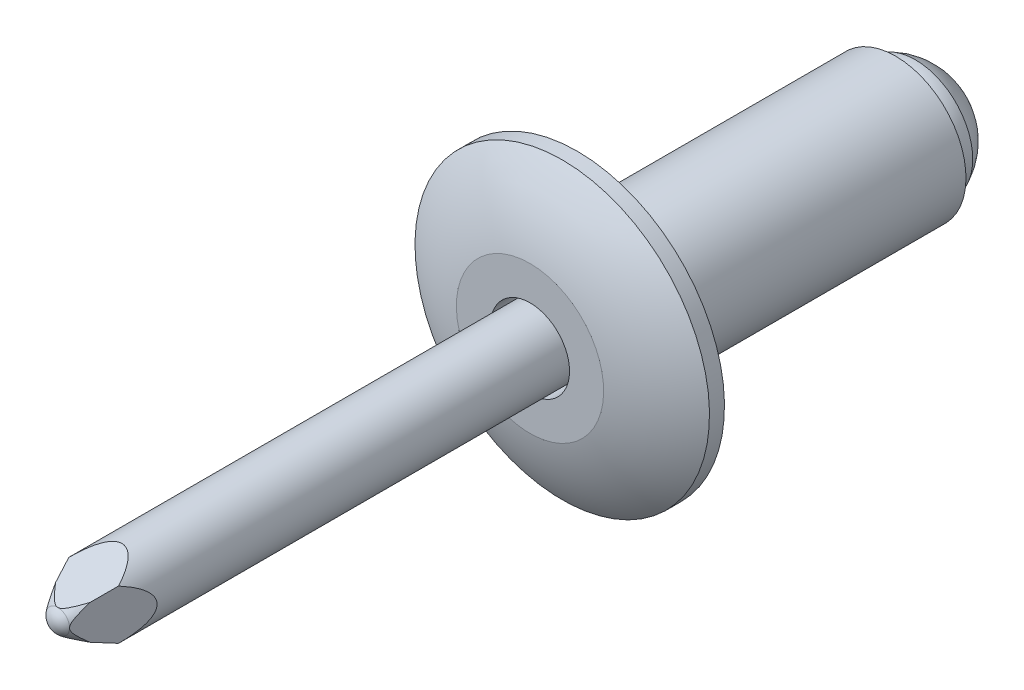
ISO-10303-21;
HEADER;
FILE_DESCRIPTION(('STEP AP214'),'2;1');
FILE_NAME('part.step','',(''),(''),'','','');
FILE_SCHEMA(('AUTOMOTIVE_DESIGN { 1 0 10303 214 1 1 1 1 }'));
ENDSEC;
DATA;
#1=APPLICATION_CONTEXT('core data for automotive mechanical design processes');
#2=APPLICATION_PROTOCOL_DEFINITION('international standard','automotive_design',2000,#1);
#3=PRODUCT_CONTEXT('',#1,'mechanical');
#4=PRODUCT('Part','Part','',(#3));
#5=PRODUCT_RELATED_PRODUCT_CATEGORY('part','',(#4));
#6=PRODUCT_DEFINITION_FORMATION('','',#4);
#7=PRODUCT_DEFINITION_CONTEXT('part definition',#1,'design');
#8=PRODUCT_DEFINITION('design','',#6,#7);
#9=PRODUCT_DEFINITION_SHAPE('','',#8);
#10=(LENGTH_UNIT() NAMED_UNIT(*) SI_UNIT(.MILLI.,.METRE.));
#11=(NAMED_UNIT(*) PLANE_ANGLE_UNIT() SI_UNIT($,.RADIAN.));
#12=(NAMED_UNIT(*) SI_UNIT($,.STERADIAN.) SOLID_ANGLE_UNIT());
#13=UNCERTAINTY_MEASURE_WITH_UNIT(LENGTH_MEASURE(1.E-05),#10,'distance_accuracy_value','');
#14=(GEOMETRIC_REPRESENTATION_CONTEXT(3) GLOBAL_UNCERTAINTY_ASSIGNED_CONTEXT((#13)) GLOBAL_UNIT_ASSIGNED_CONTEXT((#10,
#11,#12)) REPRESENTATION_CONTEXT('',''));
#15=CARTESIAN_POINT('',(0.,0.,0.));
#16=DIRECTION('',(0.,0.,1.));
#17=DIRECTION('',(1.,0.,0.));
#18=AXIS2_PLACEMENT_3D('',#15,#16,#17);
#19=CARTESIAN_POINT('',(0.,0.,-11.2391976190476));
#20=DIRECTION('',(0.,0.,1.));
#21=DIRECTION('',(0.,1.,0.));
#22=AXIS2_PLACEMENT_3D('',#19,#20,#21);
#23=SPHERICAL_SURFACE('',#22,1.95610238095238);
#24=CARTESIAN_POINT('',(0.,0.,-10.795));
#25=DIRECTION('',(0.,0.,1.));
#26=DIRECTION('',(1.,0.,0.));
#27=AXIS2_PLACEMENT_3D('',#24,#25,#26);
#28=CIRCLE('',#27,1.905);
#29=CARTESIAN_POINT('',(0.,1.905,-10.795));
#30=VERTEX_POINT('',#29);
#31=EDGE_CURVE('E11',#30,#30,#28,.T.);
#32=CARTESIAN_POINT('',(0.,0.,-11.4612964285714));
#33=DIRECTION('',(0.,0.,1.));
#34=DIRECTION('',(1.,0.,0.));
#35=AXIS2_PLACEMENT_3D('',#32,#33,#34);
#36=CIRCLE('',#35,1.94345276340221);
#37=CARTESIAN_POINT('',(0.,1.94345276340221,-11.4612964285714));
#38=VERTEX_POINT('',#37);
#39=EDGE_CURVE('E61',#38,#38,#36,.T.);
#40=CARTESIAN_POINT('',(0.,1.905,-10.795));
#41=CARTESIAN_POINT('',(0.,1.90658647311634,-10.8018037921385));
#42=CARTESIAN_POINT('',(0.,1.9081364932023,-10.8086160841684));
#43=CARTESIAN_POINT('',(0.,1.91116345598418,-10.8222568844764));
#44=CARTESIAN_POINT('',(0.,1.9126403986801,-10.8290853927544));
#45=CARTESIAN_POINT('',(0.,1.91552103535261,-10.8427578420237));
#46=CARTESIAN_POINT('',(0.,1.9169247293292,-10.8496017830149));
#47=CARTESIAN_POINT('',(0.,1.91965870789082,-10.863304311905));
#48=CARTESIAN_POINT('',(0.,1.92098899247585,-10.870162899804));
#49=CARTESIAN_POINT('',(0.,1.92357599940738,-10.8838939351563));
#50=CARTESIAN_POINT('',(0.,1.92483272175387,-10.8907663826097));
#51=CARTESIAN_POINT('',(0.,1.92727245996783,-10.9045243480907));
#52=CARTESIAN_POINT('',(0.,1.92845547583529,-10.9114098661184));
#53=CARTESIAN_POINT('',(0.,1.93074766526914,-10.9251931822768));
#54=CARTESIAN_POINT('',(0.,1.93185683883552,-10.9320909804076));
#55=CARTESIAN_POINT('',(0.,1.93400121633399,-10.9458980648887));
#56=CARTESIAN_POINT('',(0.,1.93503642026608,-10.9528073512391));
#57=CARTESIAN_POINT('',(0.,1.93703273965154,-10.9666366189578));
#58=CARTESIAN_POINT('',(0.,1.93799385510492,-10.9735566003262));
#59=CARTESIAN_POINT('',(0.,1.93984188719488,-10.9874064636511));
#60=CARTESIAN_POINT('',(0.,1.94072880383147,-10.9943363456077));
#61=CARTESIAN_POINT('',(0.,1.94242833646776,-11.008205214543));
#62=CARTESIAN_POINT('',(0.,1.94324095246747,-11.0151442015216));
#63=CARTESIAN_POINT('',(0.,1.94479179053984,-11.0290304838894));
#64=CARTESIAN_POINT('',(0.,1.9455300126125,-11.0359777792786));
#65=CARTESIAN_POINT('',(0.,1.94693197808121,-11.0498798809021));
#66=CARTESIAN_POINT('',(0.,1.94759572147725,-11.0568346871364));
#67=CARTESIAN_POINT('',(0.,1.94884865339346,-11.0707510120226));
#68=CARTESIAN_POINT('',(0.,1.94943784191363,-11.0777125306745));
#69=CARTESIAN_POINT('',(0.,1.95054159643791,-11.0916414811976));
#70=CARTESIAN_POINT('',(0.,1.95105616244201,-11.0986089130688));
#71=CARTESIAN_POINT('',(0.,1.95201061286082,-11.1125488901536));
#72=CARTESIAN_POINT('',(0.,1.95245049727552,-11.1195214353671));
#73=CARTESIAN_POINT('',(0.,1.95325553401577,-11.1334708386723));
#74=CARTESIAN_POINT('',(0.,1.95362068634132,-11.140447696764));
#75=CARTESIAN_POINT('',(0.,1.95427621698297,-11.1544049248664));
#76=CARTESIAN_POINT('',(0.,1.95456659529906,-11.1613852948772));
#77=CARTESIAN_POINT('',(0.,1.95507254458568,-11.1753487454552));
#78=CARTESIAN_POINT('',(0.,1.95528811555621,-11.1823318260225));
#79=CARTESIAN_POINT('',(0.,1.95564442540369,-11.1962998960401));
#80=CARTESIAN_POINT('',(0.,1.95578516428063,-11.2032848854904));
#81=CARTESIAN_POINT('',(0.,1.95599179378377,-11.2172559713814));
#82=CARTESIAN_POINT('',(0.,1.95605768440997,-11.2242420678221));
#83=CARTESIAN_POINT('',(0.,1.95611460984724,-11.2382145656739));
#84=CARTESIAN_POINT('',(0.,1.95610564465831,-11.2452009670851));
#85=CARTESIAN_POINT('',(0.,1.95601285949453,-11.2591732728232));
#86=CARTESIAN_POINT('',(0.,1.95592903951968,-11.2661591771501));
#87=CARTESIAN_POINT('',(0.,1.95568655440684,-11.2801296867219));
#88=CARTESIAN_POINT('',(0.,1.95552788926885,-11.2871142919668));
#89=CARTESIAN_POINT('',(0.,1.95513573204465,-11.3010814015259));
#90=CARTESIAN_POINT('',(0.,1.95490223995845,-11.3080639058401));
#91=CARTESIAN_POINT('',(0.,1.95436045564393,-11.3220260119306));
#92=CARTESIAN_POINT('',(0.,1.95405216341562,-11.3290056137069));
#93=CARTESIAN_POINT('',(0.,1.95336081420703,-11.342961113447));
#94=CARTESIAN_POINT('',(0.,1.95297775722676,-11.3499370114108));
#95=CARTESIAN_POINT('',(0.,1.95213692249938,-11.363884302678));
#96=CARTESIAN_POINT('',(0.,1.95167914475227,-11.3708556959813));
#97=CARTESIAN_POINT('',(0.,1.95068892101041,-11.3847931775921));
#98=CARTESIAN_POINT('',(0.,1.95015647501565,-11.3917592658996));
#99=CARTESIAN_POINT('',(0.,1.94901697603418,-11.4056853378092));
#100=CARTESIAN_POINT('',(0.,1.94840992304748,-11.4126453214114));
#101=CARTESIAN_POINT('',(0.,1.94712127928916,-11.4265583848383));
#102=CARTESIAN_POINT('',(0.,1.94643968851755,-11.4335114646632));
#103=CARTESIAN_POINT('',(0.,1.94500204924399,-11.4474099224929));
#104=CARTESIAN_POINT('',(0.,1.94424600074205,-11.4543553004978));
#105=CARTESIAN_POINT('',(0.,1.94345276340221,-11.4612964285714));
#106=B_SPLINE_CURVE_WITH_KNOTS('',3,(#40,#41,#42,#43,#44,#45,#46,#47,#48,#49,#50,#51,#52,#53,
#54,#55,#56,#57,#58,#59,#60,#61,#62,#63,#64,#65,#66,#67,#68,#69,#70,#71,#72,#73,#74,#75,#76,#77,
#78,#79,#80,#81,#82,#83,#84,#85,#86,#87,#88,#89,#90,#91,#92,#93,#94,#95,#96,#97,#98,#99,#100,
#101,#102,#103,#104,#105),.UNSPECIFIED.,.F.,.F.,(4,2,2,2,2,2,2,2,2,2,2,2,2,2,2,2,2,2,2,2,2,2,2,
2,2,2,2,2,2,2,2,2,4),(0.,0.0209588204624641,0.0419176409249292,0.0628764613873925,
0.0838352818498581,0.104794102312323,0.125752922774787,0.146711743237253,0.167670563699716,
0.188629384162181,0.209588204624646,0.23054702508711,0.251505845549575,0.27246466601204,
0.293423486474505,0.314382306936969,0.335341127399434,0.3562999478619,0.377258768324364,
0.398217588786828,0.419176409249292,0.440135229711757,0.461094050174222,0.482052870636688,
0.503011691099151,0.523970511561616,0.544929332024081,0.565888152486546,0.58684697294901,
0.607805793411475,0.628764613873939,0.649723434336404,0.670682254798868),.UNSPECIFIED.);
#107=EDGE_CURVE('BSEAM53',#30,#38,#106,.T.);
#108=ORIENTED_EDGE('',*,*,#31,.F.);
#109=ORIENTED_EDGE('',*,*,#39,.T.);
#110=ORIENTED_EDGE('',*,*,#107,.T.);
#111=ORIENTED_EDGE('',*,*,#107,.F.);
#112=EDGE_LOOP('',(#108,#110,#109,#111));
#113=FACE_BOUND('',#112,.T.);
#114=ADVANCED_FACE('F53',(#113),#23,.T.);
#115=CARTESIAN_POINT('',(0.,1.905,-10.795));
#116=DIRECTION('',(0.,0.,-1.));
#117=DIRECTION('',(-1.,0.,0.));
#118=AXIS2_PLACEMENT_3D('',#115,#116,#117);
#119=PLANE('',#118);
#120=ORIENTED_EDGE('',*,*,#31,.T.);
#121=EDGE_LOOP('',(#120));
#122=FACE_BOUND('',#121,.T.);
#123=ADVANCED_FACE('F73',(#122),#119,.F.);
#124=CARTESIAN_POINT('',(0.,0.,-10.566887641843));
#125=DIRECTION('',(0.,0.,1.));
#126=DIRECTION('',(0.,-1.,0.));
#127=AXIS2_PLACEMENT_3D('',#124,#125,#126);
#128=SPHERICAL_SURFACE('',#127,2.13938676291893);
#129=ORIENTED_EDGE('',*,*,#39,.F.);
#130=EDGE_LOOP('',(#129));
#131=FACE_BOUND('',#130,.T.);
#132=ADVANCED_FACE('F72',(#131),#128,.T.);
#133=CLOSED_SHELL('',(#114,#123,#132));
#134=MANIFOLD_SOLID_BREP('B2',#133);
#135=CARTESIAN_POINT('',(0.,0.,16.6632440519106));
#136=DIRECTION('',(0.,0.,-1.));
#137=DIRECTION('',(-1.,0.,0.));
#138=AXIS2_PLACEMENT_3D('',#135,#136,#137);
#139=CONICAL_SURFACE('',#138,1.190625,0.698131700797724);
#140=CARTESIAN_POINT('',(-0.742468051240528,0.93098267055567,16.6630440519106));
#141=CARTESIAN_POINT('',(-0.725824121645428,0.895163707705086,16.7087728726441));
#142=CARTESIAN_POINT('',(-0.709198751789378,0.85927020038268,16.7544507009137));
#143=CARTESIAN_POINT('',(-0.676010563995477,0.787210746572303,16.8456344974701));
#144=CARTESIAN_POINT('',(-0.659447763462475,0.751044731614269,16.8911404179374));
#145=CARTESIAN_POINT('',(-0.626430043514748,0.67836009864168,16.9818558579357));
#146=CARTESIAN_POINT('',(-0.609975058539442,0.641841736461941,17.0270655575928));
#147=CARTESIAN_POINT('',(-0.577227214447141,0.568204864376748,17.1170395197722));
#148=CARTESIAN_POINT('',(-0.560934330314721,0.531086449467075,17.1618038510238));
#149=CARTESIAN_POINT('',(-0.528622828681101,0.455822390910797,17.2505789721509));
#150=CARTESIAN_POINT('',(-0.512604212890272,0.417676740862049,17.2945897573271));
#151=CARTESIAN_POINT('',(-0.489001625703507,0.358848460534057,17.3594373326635));
#152=CARTESIAN_POINT('',(-0.481193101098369,0.338938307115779,17.3808910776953));
#153=CARTESIAN_POINT('',(-0.465824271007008,0.298319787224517,17.4231165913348));
#154=CARTESIAN_POINT('',(-0.458263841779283,0.277611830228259,17.4438886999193));
#155=CARTESIAN_POINT('',(-0.443524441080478,0.234780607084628,17.4843848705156));
#156=CARTESIAN_POINT('',(-0.436348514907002,0.212648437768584,17.5041005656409));
#157=CARTESIAN_POINT('',(-0.422863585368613,0.166224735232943,17.5411501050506));
#158=CARTESIAN_POINT('',(-0.416550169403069,0.141945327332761,17.5584960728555));
#159=CARTESIAN_POINT('',(-0.409137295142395,0.10515981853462,17.5788627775));
#160=CARTESIAN_POINT('',(-0.407165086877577,0.094202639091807,17.584281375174));
#161=CARTESIAN_POINT('',(-0.403749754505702,0.0716025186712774,17.5936649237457));
#162=CARTESIAN_POINT('',(-0.402305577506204,0.0599609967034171,17.5976327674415));
#163=CARTESIAN_POINT('',(-0.400313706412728,0.0379530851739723,17.6031053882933));
#164=CARTESIAN_POINT('',(-0.399661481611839,0.027670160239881,17.6048973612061));
#165=CARTESIAN_POINT('',(-0.398975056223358,0.00692827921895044,17.6067832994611));
#166=CARTESIAN_POINT('',(-0.398940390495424,-0.00353053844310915,17.6068785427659));
#167=CARTESIAN_POINT('',(-0.399493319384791,-0.0242833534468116,17.6053593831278));
#168=CARTESIAN_POINT('',(-0.400079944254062,-0.0345775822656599,17.6037476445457));
#169=CARTESIAN_POINT('',(-0.401784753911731,-0.0547766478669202,17.5990637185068));
#170=CARTESIAN_POINT('',(-0.402903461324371,-0.0646810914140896,17.5959900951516));
#171=CARTESIAN_POINT('',(-0.406579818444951,-0.0915636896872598,17.585889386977));
#172=CARTESIAN_POINT('',(-0.409578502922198,-0.108013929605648,17.5776505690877));
#173=CARTESIAN_POINT('',(-0.416309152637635,-0.139607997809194,17.5591582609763));
#174=CARTESIAN_POINT('',(-0.420045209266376,-0.154743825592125,17.548893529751));
#175=CARTESIAN_POINT('',(-0.42807692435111,-0.184544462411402,17.5268265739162));
#176=CARTESIAN_POINT('',(-0.43238763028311,-0.199174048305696,17.5149830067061));
#177=CARTESIAN_POINT('',(-0.441288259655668,-0.227694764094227,17.4905287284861));
#178=CARTESIAN_POINT('',(-0.445878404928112,-0.241585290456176,17.477917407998));
#179=CARTESIAN_POINT('',(-0.459936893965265,-0.282541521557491,17.4392920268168));
#180=CARTESIAN_POINT('',(-0.469671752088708,-0.308818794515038,17.412545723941));
#181=CARTESIAN_POINT('',(-0.48954213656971,-0.360382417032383,17.3579522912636));
#182=CARTESIAN_POINT('',(-0.499679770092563,-0.385661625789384,17.3300993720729));
#183=CARTESIAN_POINT('',(-0.520141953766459,-0.435465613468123,17.2738799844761));
#184=CARTESIAN_POINT('',(-0.530466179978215,-0.459991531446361,17.2455144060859));
#185=CARTESIAN_POINT('',(-0.557497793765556,-0.523227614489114,17.1712456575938));
#186=CARTESIAN_POINT('',(-0.57430269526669,-0.561579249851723,17.1250745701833));
#187=CARTESIAN_POINT('',(-0.608094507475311,-0.637655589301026,17.0322323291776));
#188=CARTESIAN_POINT('',(-0.625081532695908,-0.675379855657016,16.9855608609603));
#189=CARTESIAN_POINT('',(-0.658773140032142,-0.749570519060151,16.8929939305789));
#190=CARTESIAN_POINT('',(-0.675475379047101,-0.786046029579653,16.847104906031));
#191=CARTESIAN_POINT('',(-0.708934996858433,-0.85869997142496,16.7551753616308));
#192=CARTESIAN_POINT('',(-0.725692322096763,-0.894878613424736,16.709134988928));
#193=CARTESIAN_POINT('',(-0.742468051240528,-0.93098267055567,16.6630440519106));
#194=B_SPLINE_CURVE_WITH_KNOTS('',3,(#140,#141,#142,#143,#144,#145,#146,#147,#148,#149,#150,
#151,#152,#153,#154,#155,#156,#157,#158,#159,#160,#161,#162,#163,#164,#165,#166,#167,#168,#169,
#170,#171,#172,#173,#174,#175,#176,#177,#178,#179,#180,#181,#182,#183,#184,#185,#186,#187,#188,
#189,#190,#191,#192,#193),.UNSPECIFIED.,.F.,.F.,(4,2,2,2,2,2,2,2,2,2,2,2,2,2,2,2,2,2,2,2,2,2,2,
2,2,2,4),(0.,0.181274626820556,0.36259642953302,0.543795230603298,0.724965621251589,
0.90613714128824,0.997007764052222,1.08783235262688,1.17929357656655,1.27026780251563,
1.30733354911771,1.34432497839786,1.37556025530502,1.40677200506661,1.4379351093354,
1.46912888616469,1.52472639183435,1.58064152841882,1.63852084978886,1.69644673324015,
1.81258697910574,1.92944614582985,2.04611891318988,2.23309823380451,2.42020296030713,
2.60305990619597,2.78577335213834),.UNSPECIFIED.);
#195=CARTESIAN_POINT('',(-0.399031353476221,0.,17.6066286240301));
#196=VERTEX_POINT('',#195);
#197=CARTESIAN_POINT('',(-0.584495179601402,-0.584495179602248,17.0970709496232));
#198=VERTEX_POINT('',#197);
#199=EDGE_CURVE('E206',#196,#198,#194,.T.);
#200=ORIENTED_EDGE('',*,*,#199,.T.);
#201=CARTESIAN_POINT('',(-0.8160994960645,-0.689317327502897,16.8090744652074));
#202=CARTESIAN_POINT('',(-0.783898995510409,-0.674506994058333,16.8497655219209));
#203=CARTESIAN_POINT('',(-0.75161221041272,-0.659718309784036,16.890397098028));
#204=CARTESIAN_POINT('',(-0.686712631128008,-0.630212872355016,16.9714626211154));
#205=CARTESIAN_POINT('',(-0.65409967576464,-0.615496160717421,17.0118964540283));
#206=CARTESIAN_POINT('',(-0.588155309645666,-0.586057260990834,17.0927791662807));
#207=CARTESIAN_POINT('',(-0.554820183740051,-0.571336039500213,17.133225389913));
#208=CARTESIAN_POINT('',(-0.487420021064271,-0.542098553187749,17.2135547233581));
#209=CARTESIAN_POINT('',(-0.453355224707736,-0.527582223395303,17.2534380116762));
#210=CARTESIAN_POINT('',(-0.384015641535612,-0.498930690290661,17.3321574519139));
#211=CARTESIAN_POINT('',(-0.348743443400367,-0.484794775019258,17.3709955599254));
#212=CARTESIAN_POINT('',(-0.29383260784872,-0.464195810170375,17.4275907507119));
#213=CARTESIAN_POINT('',(-0.275183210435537,-0.457426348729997,17.4461896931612));
#214=CARTESIAN_POINT('',(-0.236855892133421,-0.44424040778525,17.4824177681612));
#215=CARTESIAN_POINT('',(-0.217179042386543,-0.437823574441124,17.5000478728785));
#216=CARTESIAN_POINT('',(-0.179643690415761,-0.426671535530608,17.5306878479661));
#217=CARTESIAN_POINT('',(-0.162043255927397,-0.421835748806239,17.5439740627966));
#218=CARTESIAN_POINT('',(-0.125136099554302,-0.413007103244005,17.5682305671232));
#219=CARTESIAN_POINT('',(-0.105840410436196,-0.409009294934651,17.5792144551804));
#220=CARTESIAN_POINT('',(-0.0751329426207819,-0.404247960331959,17.5922961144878));
#221=CARTESIAN_POINT('',(-0.0645674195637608,-0.402864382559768,17.596097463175));
#222=CARTESIAN_POINT('',(-0.042929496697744,-0.400682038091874,17.602093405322));
#223=CARTESIAN_POINT('',(-0.0318579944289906,-0.399882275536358,17.6042907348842));
#224=CARTESIAN_POINT('',(-0.00935351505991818,-0.398994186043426,17.6067307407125));
#225=CARTESIAN_POINT('',(0.00208189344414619,-0.398912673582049,17.6069546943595));
#226=CARTESIAN_POINT('',(0.0247797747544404,-0.399496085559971,17.6053517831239));
#227=CARTESIAN_POINT('',(0.036042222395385,-0.400161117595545,17.603524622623));
#228=CARTESIAN_POINT('',(0.0609523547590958,-0.402371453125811,17.5974517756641));
#229=CARTESIAN_POINT('',(0.0744546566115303,-0.404101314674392,17.5926990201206));
#230=CARTESIAN_POINT('',(0.100562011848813,-0.408240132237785,17.581327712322));
#231=CARTESIAN_POINT('',(0.113162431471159,-0.410652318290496,17.5747002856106));
#232=CARTESIAN_POINT('',(0.148079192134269,-0.418161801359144,17.5540681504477));
#233=CARTESIAN_POINT('',(0.169408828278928,-0.423781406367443,17.5386284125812));
#234=CARTESIAN_POINT('',(0.210401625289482,-0.435702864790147,17.5058744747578));
#235=CARTESIAN_POINT('',(0.230057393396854,-0.442007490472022,17.4885526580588));
#236=CARTESIAN_POINT('',(0.268560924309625,-0.455073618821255,17.4526537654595));
#237=CARTESIAN_POINT('',(0.287393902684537,-0.461840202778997,17.4340627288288));
#238=CARTESIAN_POINT('',(0.324300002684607,-0.475582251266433,17.3963067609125));
#239=CARTESIAN_POINT('',(0.342374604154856,-0.482557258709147,17.3771430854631));
#240=CARTESIAN_POINT('',(0.397488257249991,-0.504325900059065,17.317334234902));
#241=CARTESIAN_POINT('',(0.433726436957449,-0.519355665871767,17.2760402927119));
#242=CARTESIAN_POINT('',(0.50519621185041,-0.549714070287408,17.1926312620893));
#243=CARTESIAN_POINT('',(0.54042666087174,-0.565043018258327,17.1505153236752));
#244=CARTESIAN_POINT('',(0.608415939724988,-0.59504579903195,17.0680833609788));
#245=CARTESIAN_POINT('',(0.641206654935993,-0.609711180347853,17.0277905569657));
#246=CARTESIAN_POINT('',(0.706367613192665,-0.639117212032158,16.9469981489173));
#247=CARTESIAN_POINT('',(0.738738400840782,-0.653857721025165,16.9064989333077));
#248=CARTESIAN_POINT('',(0.771012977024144,-0.66862170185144,16.8659352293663));
#249=B_SPLINE_CURVE_WITH_KNOTS('',3,(#201,#202,#203,#204,#205,#206,#207,#208,#209,#210,#211,
#212,#213,#214,#215,#216,#217,#218,#219,#220,#221,#222,#223,#224,#225,#226,#227,#228,#229,#230,
#231,#232,#233,#234,#235,#236,#237,#238,#239,#240,#241,#242,#243,#244,#245,#246,#247,#248),
.UNSPECIFIED.,.F.,.F.,(4,2,2,2,2,2,2,2,2,2,2,2,2,2,2,2,2,2,2,2,2,2,2,4),(0.,0.161889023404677,
0.323862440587,0.48717902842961,0.650442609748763,0.81337573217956,0.89494220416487,
0.976425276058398,1.04408091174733,1.11132492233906,1.14515848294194,1.17893419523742,
1.213030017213,1.24713075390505,1.29013881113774,1.33335397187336,1.41381758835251,
1.49461990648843,1.57653075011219,1.65827352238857,1.82910667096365,2.00012696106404,
2.16206318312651,2.32376267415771),.UNSPECIFIED.);
#250=CARTESIAN_POINT('',(-2.68703274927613E-13,-0.399031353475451,17.6066286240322));
#251=VERTEX_POINT('',#250);
#252=EDGE_CURVE('E242',#198,#251,#249,.T.);
#253=ORIENTED_EDGE('',*,*,#252,.T.);
#254=CARTESIAN_POINT('',(0.,0.,17.6066286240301));
#255=DIRECTION('',(0.,0.,1.));
#256=DIRECTION('',(1.,0.,0.));
#257=AXIS2_PLACEMENT_3D('',#254,#255,#256);
#258=CIRCLE('',#257,0.399031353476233);
#259=EDGE_CURVE('E192',#196,#251,#258,.T.);
#260=ORIENTED_EDGE('',*,*,#259,.F.);
#261=EDGE_LOOP('',(#200,#253,#260));
#262=FACE_BOUND('',#261,.T.);
#263=ADVANCED_FACE('F106',(#262),#139,.T.);
#264=CARTESIAN_POINT('',(0.742468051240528,-0.93098267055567,16.6630440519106));
#265=CARTESIAN_POINT('',(0.725824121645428,-0.895163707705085,16.7087728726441));
#266=CARTESIAN_POINT('',(0.709198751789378,-0.85927020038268,16.7544507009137));
#267=CARTESIAN_POINT('',(0.676010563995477,-0.787210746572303,16.8456344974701));
#268=CARTESIAN_POINT('',(0.659447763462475,-0.751044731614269,16.8911404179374));
#269=CARTESIAN_POINT('',(0.626430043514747,-0.67836009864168,16.9818558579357));
#270=CARTESIAN_POINT('',(0.609975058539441,-0.641841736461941,17.0270655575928));
#271=CARTESIAN_POINT('',(0.577227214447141,-0.568204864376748,17.1170395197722));
#272=CARTESIAN_POINT('',(0.560934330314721,-0.531086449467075,17.1618038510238));
#273=CARTESIAN_POINT('',(0.528622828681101,-0.455822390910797,17.2505789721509));
#274=CARTESIAN_POINT('',(0.512604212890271,-0.417676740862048,17.2945897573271));
#275=CARTESIAN_POINT('',(0.489001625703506,-0.358848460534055,17.3594373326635));
#276=CARTESIAN_POINT('',(0.481193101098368,-0.338938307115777,17.3808910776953));
#277=CARTESIAN_POINT('',(0.465824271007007,-0.298319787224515,17.4231165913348));
#278=CARTESIAN_POINT('',(0.458263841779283,-0.277611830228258,17.4438886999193));
#279=CARTESIAN_POINT('',(0.443524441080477,-0.234780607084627,17.4843848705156));
#280=CARTESIAN_POINT('',(0.436348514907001,-0.212648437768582,17.5041005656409));
#281=CARTESIAN_POINT('',(0.422863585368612,-0.16622473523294,17.5411501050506));
#282=CARTESIAN_POINT('',(0.416550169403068,-0.141945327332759,17.5584960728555));
#283=CARTESIAN_POINT('',(0.409137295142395,-0.10515981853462,17.5788627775));
#284=CARTESIAN_POINT('',(0.407165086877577,-0.0942026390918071,17.584281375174));
#285=CARTESIAN_POINT('',(0.403749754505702,-0.0716025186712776,17.5936649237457));
#286=CARTESIAN_POINT('',(0.402305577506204,-0.0599609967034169,17.5976327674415));
#287=CARTESIAN_POINT('',(0.400313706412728,-0.0379530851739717,17.6031053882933));
#288=CARTESIAN_POINT('',(0.399661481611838,-0.0276701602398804,17.6048973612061));
#289=CARTESIAN_POINT('',(0.398975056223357,-0.00692827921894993,17.6067832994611));
#290=CARTESIAN_POINT('',(0.398940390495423,0.00353053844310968,17.6068785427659));
#291=CARTESIAN_POINT('',(0.399493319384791,0.024283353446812,17.6053593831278));
#292=CARTESIAN_POINT('',(0.400079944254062,0.0345775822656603,17.6037476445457));
#293=CARTESIAN_POINT('',(0.401784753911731,0.0547766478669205,17.5990637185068));
#294=CARTESIAN_POINT('',(0.402903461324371,0.0646810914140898,17.5959900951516));
#295=CARTESIAN_POINT('',(0.406579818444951,0.0915636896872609,17.585889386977));
#296=CARTESIAN_POINT('',(0.409578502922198,0.10801392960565,17.5776505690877));
#297=CARTESIAN_POINT('',(0.416309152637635,0.139607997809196,17.5591582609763));
#298=CARTESIAN_POINT('',(0.420045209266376,0.154743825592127,17.548893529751));
#299=CARTESIAN_POINT('',(0.42807692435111,0.184544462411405,17.5268265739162));
#300=CARTESIAN_POINT('',(0.432387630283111,0.1991740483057,17.5149830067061));
#301=CARTESIAN_POINT('',(0.441288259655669,0.227694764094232,17.4905287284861));
#302=CARTESIAN_POINT('',(0.445878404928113,0.241585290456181,17.477917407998));
#303=CARTESIAN_POINT('',(0.459936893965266,0.282541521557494,17.4392920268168));
#304=CARTESIAN_POINT('',(0.46967175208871,0.308818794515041,17.412545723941));
#305=CARTESIAN_POINT('',(0.489542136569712,0.360382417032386,17.3579522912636));
#306=CARTESIAN_POINT('',(0.499679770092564,0.385661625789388,17.3300993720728));
#307=CARTESIAN_POINT('',(0.520141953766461,0.435465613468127,17.2738799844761));
#308=CARTESIAN_POINT('',(0.530466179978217,0.459991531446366,17.2455144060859));
#309=CARTESIAN_POINT('',(0.557497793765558,0.523227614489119,17.1712456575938));
#310=CARTESIAN_POINT('',(0.574302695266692,0.561579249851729,17.1250745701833));
#311=CARTESIAN_POINT('',(0.608094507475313,0.637655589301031,17.0322323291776));
#312=CARTESIAN_POINT('',(0.625081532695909,0.67537985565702,16.9855608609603));
#313=CARTESIAN_POINT('',(0.658773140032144,0.749570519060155,16.8929939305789));
#314=CARTESIAN_POINT('',(0.675475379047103,0.786046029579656,16.847104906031));
#315=CARTESIAN_POINT('',(0.708934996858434,0.858699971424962,16.7551753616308));
#316=CARTESIAN_POINT('',(0.725692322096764,0.894878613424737,16.709134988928));
#317=CARTESIAN_POINT('',(0.742468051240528,0.93098267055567,16.6630440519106));
#318=B_SPLINE_CURVE_WITH_KNOTS('',3,(#264,#265,#266,#267,#268,#269,#270,#271,#272,#273,#274,
#275,#276,#277,#278,#279,#280,#281,#282,#283,#284,#285,#286,#287,#288,#289,#290,#291,#292,#293,
#294,#295,#296,#297,#298,#299,#300,#301,#302,#303,#304,#305,#306,#307,#308,#309,#310,#311,#312,
#313,#314,#315,#316,#317),.UNSPECIFIED.,.F.,.F.,(4,2,2,2,2,2,2,2,2,2,2,2,2,2,2,2,2,2,2,2,2,2,2,
2,2,2,4),(0.,0.181274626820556,0.362596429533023,0.543795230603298,0.724965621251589,
0.906137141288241,0.997007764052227,1.08783235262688,1.17929357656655,1.27026780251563,
1.30733354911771,1.34432497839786,1.37556025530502,1.40677200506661,1.4379351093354,
1.46912888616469,1.52472639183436,1.58064152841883,1.63852084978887,1.69644673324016,
1.81258697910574,1.92944614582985,2.04611891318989,2.23309823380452,2.42020296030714,
2.60305990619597,2.78577335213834),.UNSPECIFIED.);
#319=CARTESIAN_POINT('',(0.399031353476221,0.,17.6066286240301));
#320=VERTEX_POINT('',#319);
#321=CARTESIAN_POINT('',(0.584495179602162,0.584495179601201,17.0970709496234));
#322=VERTEX_POINT('',#321);
#323=EDGE_CURVE('E198',#320,#322,#318,.T.);
#324=ORIENTED_EDGE('',*,*,#323,.T.);
#325=CARTESIAN_POINT('',(0.816099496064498,0.689317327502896,16.8090744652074));
#326=CARTESIAN_POINT('',(0.783898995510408,0.674506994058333,16.849765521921));
#327=CARTESIAN_POINT('',(0.75161221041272,0.659718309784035,16.890397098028));
#328=CARTESIAN_POINT('',(0.686712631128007,0.630212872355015,16.9714626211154));
#329=CARTESIAN_POINT('',(0.654099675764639,0.61549616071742,17.0118964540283));
#330=CARTESIAN_POINT('',(0.588155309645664,0.586057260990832,17.0927791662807));
#331=CARTESIAN_POINT('',(0.554820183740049,0.571336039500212,17.133225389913));
#332=CARTESIAN_POINT('',(0.48742002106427,0.542098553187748,17.2135547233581));
#333=CARTESIAN_POINT('',(0.453355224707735,0.527582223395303,17.2534380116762));
#334=CARTESIAN_POINT('',(0.384015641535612,0.49893069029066,17.3321574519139));
#335=CARTESIAN_POINT('',(0.348743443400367,0.484794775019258,17.3709955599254));
#336=CARTESIAN_POINT('',(0.29383260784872,0.464195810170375,17.4275907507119));
#337=CARTESIAN_POINT('',(0.275183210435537,0.457426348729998,17.4461896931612));
#338=CARTESIAN_POINT('',(0.236855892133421,0.44424040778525,17.4824177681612));
#339=CARTESIAN_POINT('',(0.217179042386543,0.437823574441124,17.5000478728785));
#340=CARTESIAN_POINT('',(0.179643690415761,0.426671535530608,17.5306878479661));
#341=CARTESIAN_POINT('',(0.162043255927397,0.421835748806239,17.5439740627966));
#342=CARTESIAN_POINT('',(0.125136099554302,0.413007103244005,17.5682305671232));
#343=CARTESIAN_POINT('',(0.105840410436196,0.409009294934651,17.5792144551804));
#344=CARTESIAN_POINT('',(0.0751329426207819,0.404247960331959,17.5922961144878));
#345=CARTESIAN_POINT('',(0.0645674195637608,0.402864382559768,17.596097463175));
#346=CARTESIAN_POINT('',(0.0429294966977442,0.400682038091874,17.602093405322));
#347=CARTESIAN_POINT('',(0.0318579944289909,0.399882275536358,17.6042907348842));
#348=CARTESIAN_POINT('',(0.00935351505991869,0.398994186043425,17.6067307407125));
#349=CARTESIAN_POINT('',(-0.00208189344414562,0.398912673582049,17.6069546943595));
#350=CARTESIAN_POINT('',(-0.0247797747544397,0.399496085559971,17.6053517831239));
#351=CARTESIAN_POINT('',(-0.0360422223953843,0.400161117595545,17.603524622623));
#352=CARTESIAN_POINT('',(-0.0609523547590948,0.40237145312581,17.5974517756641));
#353=CARTESIAN_POINT('',(-0.0744546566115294,0.404101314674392,17.5926990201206));
#354=CARTESIAN_POINT('',(-0.100562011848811,0.408240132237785,17.581327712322));
#355=CARTESIAN_POINT('',(-0.113162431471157,0.410652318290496,17.5747002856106));
#356=CARTESIAN_POINT('',(-0.148079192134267,0.418161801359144,17.5540681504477));
#357=CARTESIAN_POINT('',(-0.169408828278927,0.423781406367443,17.5386284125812));
#358=CARTESIAN_POINT('',(-0.210401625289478,0.435702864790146,17.5058744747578));
#359=CARTESIAN_POINT('',(-0.230057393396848,0.44200749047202,17.4885526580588));
#360=CARTESIAN_POINT('',(-0.268560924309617,0.455073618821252,17.4526537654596));
#361=CARTESIAN_POINT('',(-0.287393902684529,0.461840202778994,17.4340627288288));
#362=CARTESIAN_POINT('',(-0.324300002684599,0.47558225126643,17.3963067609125));
#363=CARTESIAN_POINT('',(-0.342374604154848,0.482557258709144,17.3771430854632));
#364=CARTESIAN_POINT('',(-0.397488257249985,0.504325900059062,17.317334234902));
#365=CARTESIAN_POINT('',(-0.433726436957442,0.519355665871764,17.276040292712));
#366=CARTESIAN_POINT('',(-0.505196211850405,0.549714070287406,17.1926312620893));
#367=CARTESIAN_POINT('',(-0.540426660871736,0.565043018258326,17.1505153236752));
#368=CARTESIAN_POINT('',(-0.608415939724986,0.595045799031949,17.0680833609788));
#369=CARTESIAN_POINT('',(-0.641206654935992,0.609711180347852,17.0277905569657));
#370=CARTESIAN_POINT('',(-0.706367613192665,0.639117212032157,16.9469981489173));
#371=CARTESIAN_POINT('',(-0.738738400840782,0.653857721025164,16.9064989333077));
#372=CARTESIAN_POINT('',(-0.771012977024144,0.66862170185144,16.8659352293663));
#373=B_SPLINE_CURVE_WITH_KNOTS('',3,(#325,#326,#327,#328,#329,#330,#331,#332,#333,#334,#335,
#336,#337,#338,#339,#340,#341,#342,#343,#344,#345,#346,#347,#348,#349,#350,#351,#352,#353,#354,
#355,#356,#357,#358,#359,#360,#361,#362,#363,#364,#365,#366,#367,#368,#369,#370,#371,#372),
.UNSPECIFIED.,.F.,.F.,(4,2,2,2,2,2,2,2,2,2,2,2,2,2,2,2,2,2,2,2,2,2,2,4),(0.,0.161889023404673,
0.323862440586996,0.48717902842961,0.650442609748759,0.813375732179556,0.894942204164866,
0.976425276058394,1.04408091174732,1.11132492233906,1.14515848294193,1.17893419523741,
1.213030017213,1.24713075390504,1.29013881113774,1.33335397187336,1.4138175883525,
1.49461990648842,1.57653075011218,1.65827352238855,1.82910667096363,2.00012696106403,
2.16206318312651,2.32376267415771),.UNSPECIFIED.);
#374=CARTESIAN_POINT('',(2.68703274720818E-13,0.399031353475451,17.6066286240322));
#375=VERTEX_POINT('',#374);
#376=EDGE_CURVE('E125',#322,#375,#373,.T.);
#377=ORIENTED_EDGE('',*,*,#376,.T.);
#378=EDGE_CURVE('E183',#320,#375,#258,.T.);
#379=ORIENTED_EDGE('',*,*,#378,.F.);
#380=EDGE_LOOP('',(#324,#377,#379));
#381=FACE_BOUND('',#380,.T.);
#382=ADVANCED_FACE('F231',(#381),#139,.T.);
#383=EDGE_CURVE('E191',#251,#320,#258,.T.);
#384=ORIENTED_EDGE('',*,*,#383,.F.);
#385=CARTESIAN_POINT('',(0.584495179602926,-0.584495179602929,17.0970709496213));
#386=VERTEX_POINT('',#385);
#387=EDGE_CURVE('E257',#251,#386,#249,.T.);
#388=ORIENTED_EDGE('',*,*,#387,.T.);
#389=EDGE_CURVE('E200',#386,#320,#318,.T.);
#390=ORIENTED_EDGE('',*,*,#389,.T.);
#391=EDGE_LOOP('',(#384,#388,#390));
#392=FACE_BOUND('',#391,.T.);
#393=ADVANCED_FACE('F233',(#392),#139,.T.);
#394=CARTESIAN_POINT('',(0.,1.190625,-1.0795));
#395=DIRECTION('',(0.,0.,1.));
#396=DIRECTION('',(1.,0.,0.));
#397=AXIS2_PLACEMENT_3D('',#394,#395,#396);
#398=PLANE('',#397);
#399=CARTESIAN_POINT('',(0.,0.,-1.0795));
#400=DIRECTION('',(0.,0.,1.));
#401=DIRECTION('',(1.,0.,0.));
#402=AXIS2_PLACEMENT_3D('',#399,#400,#401);
#403=CIRCLE('',#402,1.190625);
#404=CARTESIAN_POINT('',(1.190625,0.,-1.0795));
#405=VERTEX_POINT('',#404);
#406=EDGE_CURVE('E194',#405,#405,#403,.T.);
#407=ORIENTED_EDGE('',*,*,#406,.F.);
#408=EDGE_LOOP('',(#407));
#409=FACE_BOUND('',#408,.T.);
#410=ADVANCED_FACE('F108',(#409),#398,.F.);
#411=CARTESIAN_POINT('',(0.,0.,17.2718015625));
#412=DIRECTION('',(0.,0.,1.));
#413=DIRECTION('',(0.,1.,0.));
#414=AXIS2_PLACEMENT_3D('',#411,#412,#413);
#415=SPHERICAL_SURFACE('',#414,0.5208984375);
#416=CARTESIAN_POINT('',(0.,0.,17.7927));
#417=VERTEX_POINT('',#416);
#418=VERTEX_LOOP('',#417);
#419=FACE_BOUND('',#418,.T.);
#420=ORIENTED_EDGE('',*,*,#378,.T.);
#421=EDGE_CURVE('E188',#375,#196,#258,.T.);
#422=ORIENTED_EDGE('',*,*,#421,.T.);
#423=ORIENTED_EDGE('',*,*,#259,.T.);
#424=ORIENTED_EDGE('',*,*,#383,.T.);
#425=EDGE_LOOP('',(#420,#422,#423,#424));
#426=FACE_BOUND('',#425,.T.);
#427=ADVANCED_FACE('F230',(#419,#426),#415,.T.);
#428=ORIENTED_EDGE('',*,*,#421,.F.);
#429=CARTESIAN_POINT('',(-0.584495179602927,0.58449517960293,17.0970709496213));
#430=VERTEX_POINT('',#429);
#431=EDGE_CURVE('E280',#375,#430,#373,.T.);
#432=ORIENTED_EDGE('',*,*,#431,.T.);
#433=EDGE_CURVE('E210',#430,#196,#194,.T.);
#434=ORIENTED_EDGE('',*,*,#433,.T.);
#435=EDGE_LOOP('',(#428,#432,#434));
#436=FACE_BOUND('',#435,.T.);
#437=ADVANCED_FACE('F215',(#436),#139,.T.);
#438=CARTESIAN_POINT('',(0.,0.,17.7927));
#439=DIRECTION('',(0.,0.,1.));
#440=DIRECTION('',(1.,0.,0.));
#441=AXIS2_PLACEMENT_3D('',#438,#439,#440);
#442=CYLINDRICAL_SURFACE('',#441,1.190625);
#443=CARTESIAN_POINT('',(0.,0.,18.7029582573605));
#444=DIRECTION('',(-0.939692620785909,0.,-0.342020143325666));
#445=DIRECTION('',(-0.342020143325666,0.,0.939692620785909));
#446=AXIS2_PLACEMENT_3D('',#443,#444,#445);
#447=ELLIPSE('',#446,3.4811546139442,1.190625);
#448=CARTESIAN_POINT('',(0.841899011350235,0.841899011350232,16.3898597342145));
#449=VERTEX_POINT('',#448);
#450=CARTESIAN_POINT('',(0.841899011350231,-0.841899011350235,16.3898597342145));
#451=VERTEX_POINT('',#450);
#452=EDGE_CURVE('E166',#449,#451,#447,.T.);
#453=ORIENTED_EDGE('',*,*,#452,.T.);
#454=CARTESIAN_POINT('',(0.,0.,18.7029582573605));
#455=DIRECTION('',(0.,0.939692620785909,-0.342020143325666));
#456=DIRECTION('',(0.,0.342020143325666,0.939692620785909));
#457=AXIS2_PLACEMENT_3D('',#454,#455,#456);
#458=ELLIPSE('',#457,3.4811546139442,1.190625);
#459=CARTESIAN_POINT('',(-0.841899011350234,-0.841899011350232,16.3898597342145));
#460=VERTEX_POINT('',#459);
#461=EDGE_CURVE('E130',#451,#460,#458,.T.);
#462=ORIENTED_EDGE('',*,*,#461,.T.);
#463=CARTESIAN_POINT('',(0.,0.,18.7029582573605));
#464=DIRECTION('',(0.939692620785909,0.,-0.342020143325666));
#465=DIRECTION('',(0.342020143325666,0.,0.939692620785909));
#466=AXIS2_PLACEMENT_3D('',#463,#464,#465);
#467=ELLIPSE('',#466,3.4811546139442,1.190625);
#468=CARTESIAN_POINT('',(-0.841899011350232,0.841899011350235,16.3898597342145));
#469=VERTEX_POINT('',#468);
#470=EDGE_CURVE('E174',#460,#469,#467,.T.);
#471=ORIENTED_EDGE('',*,*,#470,.T.);
#472=CARTESIAN_POINT('',(0.,0.,18.7029582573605));
#473=DIRECTION('',(0.,-0.939692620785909,-0.342020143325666));
#474=DIRECTION('',(0.,-0.342020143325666,0.939692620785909));
#475=AXIS2_PLACEMENT_3D('',#472,#473,#474);
#476=ELLIPSE('',#475,3.4811546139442,1.190625);
#477=EDGE_CURVE('E163',#469,#449,#476,.T.);
#478=ORIENTED_EDGE('',*,*,#477,.T.);
#479=EDGE_LOOP('',(#453,#462,#471,#478));
#480=FACE_BOUND('',#479,.T.);
#481=ORIENTED_EDGE('',*,*,#406,.T.);
#482=EDGE_LOOP('',(#481));
#483=FACE_BOUND('',#482,.T.);
#484=ADVANCED_FACE('F175',(#480,#483),#442,.T.);
#485=CARTESIAN_POINT('',(-1.393825,-4.9911,14.8734555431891));
#486=DIRECTION('',(0.939692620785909,0.,-0.342020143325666));
#487=DIRECTION('',(-0.342020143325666,0.,-0.939692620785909));
#488=AXIS2_PLACEMENT_3D('',#485,#486,#487);
#489=PLANE('',#488);
#490=ORIENTED_EDGE('',*,*,#470,.F.);
#491=DIRECTION('',(0.323615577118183,0.323615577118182,0.88912649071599));
#492=VECTOR('',#491,1.);
#493=CARTESIAN_POINT('',(-1.77055696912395,-1.77055696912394,13.8383929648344));
#494=LINE('',#493,#492);
#495=EDGE_CURVE('E249',#460,#198,#494,.T.);
#496=ORIENTED_EDGE('',*,*,#495,.T.);
#497=ORIENTED_EDGE('',*,*,#199,.F.);
#498=ORIENTED_EDGE('',*,*,#433,.F.);
#499=DIRECTION('',(-0.323615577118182,0.323615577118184,-0.88912649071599));
#500=VECTOR('',#499,1.);
#501=CARTESIAN_POINT('',(-0.725150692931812,0.725150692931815,16.7106231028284));
#502=LINE('',#501,#500);
#503=EDGE_CURVE('E278',#430,#469,#502,.T.);
#504=ORIENTED_EDGE('',*,*,#503,.T.);
#505=EDGE_LOOP('',(#490,#496,#497,#498,#504));
#506=FACE_BOUND('',#505,.T.);
#507=ADVANCED_FACE('F216',(#506),#489,.F.);
#508=CARTESIAN_POINT('',(0.331306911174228,-4.9911,17.7927));
#509=DIRECTION('',(-0.939692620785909,0.,-0.342020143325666));
#510=DIRECTION('',(-0.342020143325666,0.,0.939692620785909));
#511=AXIS2_PLACEMENT_3D('',#508,#509,#510);
#512=PLANE('',#511);
#513=ORIENTED_EDGE('',*,*,#389,.F.);
#514=DIRECTION('',(0.323615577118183,-0.323615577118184,-0.889126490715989));
#515=VECTOR('',#514,1.);
#516=CARTESIAN_POINT('',(0.819313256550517,-0.819313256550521,16.4519135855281));
#517=LINE('',#516,#515);
#518=EDGE_CURVE('E55',#386,#451,#517,.T.);
#519=ORIENTED_EDGE('',*,*,#518,.T.);
#520=ORIENTED_EDGE('',*,*,#452,.F.);
#521=DIRECTION('',(-0.323615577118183,-0.323615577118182,0.88912649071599));
#522=VECTOR('',#521,1.);
#523=CARTESIAN_POINT('',(-0.226093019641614,-0.226093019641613,19.3241437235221));
#524=LINE('',#523,#522);
#525=EDGE_CURVE('E114',#449,#322,#524,.T.);
#526=ORIENTED_EDGE('',*,*,#525,.T.);
#527=ORIENTED_EDGE('',*,*,#323,.F.);
#528=EDGE_LOOP('',(#513,#519,#520,#526,#527));
#529=FACE_BOUND('',#528,.T.);
#530=ADVANCED_FACE('F177',(#529),#512,.F.);
#531=CARTESIAN_POINT('',(-1.190625,1.393825,14.8734555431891));
#532=DIRECTION('',(0.,-0.939692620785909,-0.342020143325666));
#533=DIRECTION('',(0.,0.342020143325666,-0.939692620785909));
#534=AXIS2_PLACEMENT_3D('',#531,#532,#533);
#535=PLANE('',#534);
#536=ORIENTED_EDGE('',*,*,#376,.F.);
#537=ORIENTED_EDGE('',*,*,#525,.F.);
#538=ORIENTED_EDGE('',*,*,#477,.F.);
#539=ORIENTED_EDGE('',*,*,#503,.F.);
#540=ORIENTED_EDGE('',*,*,#431,.F.);
#541=EDGE_LOOP('',(#536,#537,#538,#539,#540));
#542=FACE_BOUND('',#541,.T.);
#543=ADVANCED_FACE('F156',(#542),#535,.F.);
#544=CARTESIAN_POINT('',(-1.19062500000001,-0.331306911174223,17.7927));
#545=DIRECTION('',(0.,0.939692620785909,-0.342020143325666));
#546=DIRECTION('',(0.,0.342020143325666,0.939692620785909));
#547=AXIS2_PLACEMENT_3D('',#544,#545,#546);
#548=PLANE('',#547);
#549=ORIENTED_EDGE('',*,*,#461,.F.);
#550=ORIENTED_EDGE('',*,*,#518,.F.);
#551=ORIENTED_EDGE('',*,*,#387,.F.);
#552=ORIENTED_EDGE('',*,*,#252,.F.);
#553=ORIENTED_EDGE('',*,*,#495,.F.);
#554=EDGE_LOOP('',(#549,#550,#551,#552,#553));
#555=FACE_BOUND('',#554,.T.);
#556=ADVANCED_FACE('F270',(#555),#548,.F.);
#557=CLOSED_SHELL('',(#263,#382,#393,#410,#427,#437,#484,#507,#530,#543,#556));
#558=MANIFOLD_SOLID_BREP('B6',#557);
#559=CARTESIAN_POINT('',(0.,2.38125,0.));
#560=DIRECTION('',(0.,0.,-1.));
#561=DIRECTION('',(0.,1.,0.));
#562=AXIS2_PLACEMENT_3D('',#559,#560,#561);
#563=PLANE('',#562);
#564=CARTESIAN_POINT('',(0.,0.,0.));
#565=DIRECTION('',(0.,0.,-1.));
#566=DIRECTION('',(0.,1.,0.));
#567=AXIS2_PLACEMENT_3D('',#564,#565,#566);
#568=CIRCLE('',#567,3.05340903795);
#569=CARTESIAN_POINT('',(0.,3.05340903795,0.));
#570=VERTEX_POINT('',#569);
#571=EDGE_CURVE('E430',#570,#570,#568,.F.);
#572=ORIENTED_EDGE('',*,*,#571,.F.);
#573=EDGE_LOOP('',(#572));
#574=FACE_BOUND('',#573,.T.);
#575=CARTESIAN_POINT('',(0.,0.,0.));
#576=DIRECTION('',(0.,0.,-1.));
#577=DIRECTION('',(0.,1.,0.));
#578=AXIS2_PLACEMENT_3D('',#575,#576,#577);
#579=CIRCLE('',#578,2.8613632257);
#580=CARTESIAN_POINT('',(0.,2.8613632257,0.));
#581=VERTEX_POINT('',#580);
#582=EDGE_CURVE('E102',#581,#581,#579,.T.);
#583=ORIENTED_EDGE('',*,*,#582,.F.);
#584=EDGE_LOOP('',(#583));
#585=FACE_BOUND('',#584,.T.);
#586=ADVANCED_FACE('F383',(#574,#585),#563,.T.);
#587=CARTESIAN_POINT('',(0.,0.,0.));
#588=DIRECTION('',(0.,0.,-1.));
#589=DIRECTION('',(0.,1.,0.));
#590=AXIS2_PLACEMENT_3D('',#587,#588,#589);
#591=CIRCLE('',#590,4.353410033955);
#592=CARTESIAN_POINT('',(0.,4.353410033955,0.));
#593=VERTEX_POINT('',#592);
#594=EDGE_CURVE('E399',#593,#593,#591,.F.);
#595=ORIENTED_EDGE('',*,*,#594,.F.);
#596=EDGE_LOOP('',(#595));
#597=FACE_BOUND('',#596,.T.);
#598=CARTESIAN_POINT('',(0.,0.,0.));
#599=DIRECTION('',(0.,0.,-1.));
#600=DIRECTION('',(0.,1.,0.));
#601=AXIS2_PLACEMENT_3D('',#598,#599,#600);
#602=CIRCLE('',#601,3.97424241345);
#603=CARTESIAN_POINT('',(0.,3.97424241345,0.));
#604=VERTEX_POINT('',#603);
#605=EDGE_CURVE('E411',#604,#604,#602,.T.);
#606=ORIENTED_EDGE('',*,*,#605,.F.);
#607=EDGE_LOOP('',(#606));
#608=FACE_BOUND('',#607,.T.);
#609=ADVANCED_FACE('F523',(#597,#608),#563,.T.);
#610=CARTESIAN_POINT('',(0.,0.,0.));
#611=DIRECTION('',(0.,0.,-1.));
#612=DIRECTION('',(0.,1.,0.));
#613=AXIS2_PLACEMENT_3D('',#610,#611,#612);
#614=CIRCLE('',#613,3.82651446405);
#615=CARTESIAN_POINT('',(0.,3.82651446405,0.));
#616=VERTEX_POINT('',#615);
#617=EDGE_CURVE('E412',#616,#616,#614,.F.);
#618=ORIENTED_EDGE('',*,*,#617,.F.);
#619=EDGE_LOOP('',(#618));
#620=FACE_BOUND('',#619,.T.);
#621=CARTESIAN_POINT('',(0.,0.,0.));
#622=DIRECTION('',(0.,0.,-1.));
#623=DIRECTION('',(0.,1.,0.));
#624=AXIS2_PLACEMENT_3D('',#621,#622,#623);
#625=CIRCLE('',#624,3.60984941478);
#626=CARTESIAN_POINT('',(0.,3.60984941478,0.));
#627=VERTEX_POINT('',#626);
#628=EDGE_CURVE('E421',#627,#627,#625,.T.);
#629=ORIENTED_EDGE('',*,*,#628,.F.);
#630=EDGE_LOOP('',(#629));
#631=FACE_BOUND('',#630,.T.);
#632=ADVANCED_FACE('F535',(#620,#631),#563,.T.);
#633=CARTESIAN_POINT('',(0.,0.,0.));
#634=DIRECTION('',(0.,0.,-1.));
#635=DIRECTION('',(0.,1.,0.));
#636=AXIS2_PLACEMENT_3D('',#633,#634,#635);
#637=CIRCLE('',#636,3.46212146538);
#638=CARTESIAN_POINT('',(0.,3.46212146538,0.));
#639=VERTEX_POINT('',#638);
#640=EDGE_CURVE('E419',#639,#639,#637,.F.);
#641=ORIENTED_EDGE('',*,*,#640,.F.);
#642=EDGE_LOOP('',(#641));
#643=FACE_BOUND('',#642,.T.);
#644=CARTESIAN_POINT('',(0.,0.,0.));
#645=DIRECTION('',(0.,0.,-1.));
#646=DIRECTION('',(0.,1.,0.));
#647=AXIS2_PLACEMENT_3D('',#644,#645,#646);
#648=CIRCLE('',#647,3.20113698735);
#649=CARTESIAN_POINT('',(0.,3.20113698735,0.));
#650=VERTEX_POINT('',#649);
#651=EDGE_CURVE('E431',#650,#650,#648,.T.);
#652=ORIENTED_EDGE('',*,*,#651,.F.);
#653=EDGE_LOOP('',(#652));
#654=FACE_BOUND('',#653,.T.);
#655=ADVANCED_FACE('F542',(#643,#654),#563,.T.);
#656=CARTESIAN_POINT('',(0.,0.,17.7927));
#657=DIRECTION('',(0.,0.,1.));
#658=DIRECTION('',(1.,0.,0.));
#659=AXIS2_PLACEMENT_3D('',#656,#657,#658);
#660=CYLINDRICAL_SURFACE('',#659,3.05340903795);
#661=ORIENTED_EDGE('',*,*,#571,.T.);
#662=EDGE_LOOP('',(#661));
#663=FACE_BOUND('',#662,.T.);
#664=CARTESIAN_POINT('',(0.,0.,-0.0254000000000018));
#665=DIRECTION('',(0.,0.,1.));
#666=DIRECTION('',(1.,0.,0.));
#667=AXIS2_PLACEMENT_3D('',#664,#665,#666);
#668=CIRCLE('',#667,3.05340903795);
#669=CARTESIAN_POINT('',(3.05340903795,0.,-0.0254000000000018));
#670=VERTEX_POINT('',#669);
#671=EDGE_CURVE('E463',#670,#670,#668,.T.);
#672=ORIENTED_EDGE('',*,*,#671,.F.);
#673=EDGE_LOOP('',(#672));
#674=FACE_BOUND('',#673,.T.);
#675=ADVANCED_FACE('F555',(#663,#674),#660,.F.);
#676=CARTESIAN_POINT('',(3.05340903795,0.,-0.0254000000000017));
#677=DIRECTION('',(0.,0.,-1.));
#678=DIRECTION('',(-1.,0.,0.));
#679=AXIS2_PLACEMENT_3D('',#676,#677,#678);
#680=PLANE('',#679);
#681=ORIENTED_EDGE('',*,*,#671,.T.);
#682=EDGE_LOOP('',(#681));
#683=FACE_BOUND('',#682,.T.);
#684=CARTESIAN_POINT('',(0.,0.,-0.0254000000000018));
#685=DIRECTION('',(0.,0.,1.));
#686=DIRECTION('',(1.,0.,0.));
#687=AXIS2_PLACEMENT_3D('',#684,#685,#686);
#688=CIRCLE('',#687,3.20113698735);
#689=CARTESIAN_POINT('',(3.20113698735,0.,-0.0254000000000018));
#690=VERTEX_POINT('',#689);
#691=EDGE_CURVE('E470',#690,#690,#688,.T.);
#692=ORIENTED_EDGE('',*,*,#691,.F.);
#693=EDGE_LOOP('',(#692));
#694=FACE_BOUND('',#693,.T.);
#695=ADVANCED_FACE('F557',(#683,#694),#680,.T.);
#696=CARTESIAN_POINT('',(0.,0.,17.7927));
#697=DIRECTION('',(0.,0.,1.));
#698=DIRECTION('',(1.,0.,0.));
#699=AXIS2_PLACEMENT_3D('',#696,#697,#698);
#700=CYLINDRICAL_SURFACE('',#699,3.20113698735);
#701=ORIENTED_EDGE('',*,*,#691,.T.);
#702=EDGE_LOOP('',(#701));
#703=FACE_BOUND('',#702,.T.);
#704=ORIENTED_EDGE('',*,*,#651,.T.);
#705=EDGE_LOOP('',(#704));
#706=FACE_BOUND('',#705,.T.);
#707=ADVANCED_FACE('F570',(#703,#706),#700,.T.);
#708=CARTESIAN_POINT('',(0.,0.,17.7927));
#709=DIRECTION('',(0.,0.,1.));
#710=DIRECTION('',(1.,0.,0.));
#711=AXIS2_PLACEMENT_3D('',#708,#709,#710);
#712=CYLINDRICAL_SURFACE('',#711,3.46212146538);
#713=ORIENTED_EDGE('',*,*,#640,.T.);
#714=EDGE_LOOP('',(#713));
#715=FACE_BOUND('',#714,.T.);
#716=CARTESIAN_POINT('',(0.,0.,-0.0254000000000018));
#717=DIRECTION('',(0.,0.,1.));
#718=DIRECTION('',(1.,0.,0.));
#719=AXIS2_PLACEMENT_3D('',#716,#717,#718);
#720=CIRCLE('',#719,3.46212146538);
#721=CARTESIAN_POINT('',(3.46212146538,0.,-0.0254000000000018));
#722=VERTEX_POINT('',#721);
#723=EDGE_CURVE('E471',#722,#722,#720,.T.);
#724=ORIENTED_EDGE('',*,*,#723,.F.);
#725=EDGE_LOOP('',(#724));
#726=FACE_BOUND('',#725,.T.);
#727=ADVANCED_FACE('F567',(#715,#726),#712,.F.);
#728=CARTESIAN_POINT('',(3.46212146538,0.,-0.0254000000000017));
#729=DIRECTION('',(0.,0.,-1.));
#730=DIRECTION('',(-1.,0.,0.));
#731=AXIS2_PLACEMENT_3D('',#728,#729,#730);
#732=PLANE('',#731);
#733=ORIENTED_EDGE('',*,*,#723,.T.);
#734=EDGE_LOOP('',(#733));
#735=FACE_BOUND('',#734,.T.);
#736=CARTESIAN_POINT('',(0.,0.,-0.0254000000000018));
#737=DIRECTION('',(0.,0.,1.));
#738=DIRECTION('',(1.,0.,0.));
#739=AXIS2_PLACEMENT_3D('',#736,#737,#738);
#740=CIRCLE('',#739,3.60984941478);
#741=CARTESIAN_POINT('',(3.60984941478,0.,-0.0254000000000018));
#742=VERTEX_POINT('',#741);
#743=EDGE_CURVE('E475',#742,#742,#740,.T.);
#744=ORIENTED_EDGE('',*,*,#743,.F.);
#745=EDGE_LOOP('',(#744));
#746=FACE_BOUND('',#745,.T.);
#747=ADVANCED_FACE('F577',(#735,#746),#732,.T.);
#748=CARTESIAN_POINT('',(0.,0.,17.7927));
#749=DIRECTION('',(0.,0.,1.));
#750=DIRECTION('',(1.,0.,0.));
#751=AXIS2_PLACEMENT_3D('',#748,#749,#750);
#752=CYLINDRICAL_SURFACE('',#751,3.60984941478);
#753=ORIENTED_EDGE('',*,*,#743,.T.);
#754=EDGE_LOOP('',(#753));
#755=FACE_BOUND('',#754,.T.);
#756=ORIENTED_EDGE('',*,*,#628,.T.);
#757=EDGE_LOOP('',(#756));
#758=FACE_BOUND('',#757,.T.);
#759=ADVANCED_FACE('F583',(#755,#758),#752,.T.);
#760=CARTESIAN_POINT('',(0.,0.,17.7927));
#761=DIRECTION('',(0.,0.,1.));
#762=DIRECTION('',(1.,0.,0.));
#763=AXIS2_PLACEMENT_3D('',#760,#761,#762);
#764=CYLINDRICAL_SURFACE('',#763,3.82651446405);
#765=ORIENTED_EDGE('',*,*,#617,.T.);
#766=EDGE_LOOP('',(#765));
#767=FACE_BOUND('',#766,.T.);
#768=CARTESIAN_POINT('',(0.,0.,-0.0254000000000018));
#769=DIRECTION('',(0.,0.,1.));
#770=DIRECTION('',(1.,0.,0.));
#771=AXIS2_PLACEMENT_3D('',#768,#769,#770);
#772=CIRCLE('',#771,3.82651446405);
#773=CARTESIAN_POINT('',(3.82651446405,0.,-0.0254000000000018));
#774=VERTEX_POINT('',#773);
#775=EDGE_CURVE('E479',#774,#774,#772,.T.);
#776=ORIENTED_EDGE('',*,*,#775,.F.);
#777=EDGE_LOOP('',(#776));
#778=FACE_BOUND('',#777,.T.);
#779=ADVANCED_FACE('F588',(#767,#778),#764,.F.);
#780=CARTESIAN_POINT('',(3.82651446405,0.,-0.0254000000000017));
#781=DIRECTION('',(0.,0.,-1.));
#782=DIRECTION('',(-1.,0.,0.));
#783=AXIS2_PLACEMENT_3D('',#780,#781,#782);
#784=PLANE('',#783);
#785=ORIENTED_EDGE('',*,*,#775,.T.);
#786=EDGE_LOOP('',(#785));
#787=FACE_BOUND('',#786,.T.);
#788=CARTESIAN_POINT('',(0.,0.,-0.0254000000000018));
#789=DIRECTION('',(0.,0.,1.));
#790=DIRECTION('',(1.,0.,0.));
#791=AXIS2_PLACEMENT_3D('',#788,#789,#790);
#792=CIRCLE('',#791,3.97424241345);
#793=CARTESIAN_POINT('',(3.97424241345,0.,-0.0254000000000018));
#794=VERTEX_POINT('',#793);
#795=EDGE_CURVE('E483',#794,#794,#792,.T.);
#796=ORIENTED_EDGE('',*,*,#795,.F.);
#797=EDGE_LOOP('',(#796));
#798=FACE_BOUND('',#797,.T.);
#799=ADVANCED_FACE('F595',(#787,#798),#784,.T.);
#800=CARTESIAN_POINT('',(0.,0.,17.7927));
#801=DIRECTION('',(0.,0.,1.));
#802=DIRECTION('',(1.,0.,0.));
#803=AXIS2_PLACEMENT_3D('',#800,#801,#802);
#804=CYLINDRICAL_SURFACE('',#803,3.97424241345);
#805=ORIENTED_EDGE('',*,*,#795,.T.);
#806=EDGE_LOOP('',(#805));
#807=FACE_BOUND('',#806,.T.);
#808=ORIENTED_EDGE('',*,*,#605,.T.);
#809=EDGE_LOOP('',(#808));
#810=FACE_BOUND('',#809,.T.);
#811=ADVANCED_FACE('F597',(#807,#810),#804,.T.);
#812=CARTESIAN_POINT('',(0.,0.,17.7927));
#813=DIRECTION('',(0.,0.,1.));
#814=DIRECTION('',(1.,0.,0.));
#815=AXIS2_PLACEMENT_3D('',#812,#813,#814);
#816=CYLINDRICAL_SURFACE('',#815,4.353410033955);
#817=ORIENTED_EDGE('',*,*,#594,.T.);
#818=EDGE_LOOP('',(#817));
#819=FACE_BOUND('',#818,.T.);
#820=CARTESIAN_POINT('',(0.,0.,-0.0254000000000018));
#821=DIRECTION('',(0.,0.,1.));
#822=DIRECTION('',(1.,0.,0.));
#823=AXIS2_PLACEMENT_3D('',#820,#821,#822);
#824=CIRCLE('',#823,4.353410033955);
#825=CARTESIAN_POINT('',(4.353410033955,0.,-0.0254000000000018));
#826=VERTEX_POINT('',#825);
#827=EDGE_CURVE('E487',#826,#826,#824,.T.);
#828=ORIENTED_EDGE('',*,*,#827,.F.);
#829=EDGE_LOOP('',(#828));
#830=FACE_BOUND('',#829,.T.);
#831=ADVANCED_FACE('F598',(#819,#830),#816,.F.);
#832=CARTESIAN_POINT('',(4.353410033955,0.,-0.0254000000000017));
#833=DIRECTION('',(0.,0.,-1.));
#834=DIRECTION('',(-1.,0.,0.));
#835=AXIS2_PLACEMENT_3D('',#832,#833,#834);
#836=PLANE('',#835);
#837=ORIENTED_EDGE('',*,*,#827,.T.);
#838=EDGE_LOOP('',(#837));
#839=FACE_BOUND('',#838,.T.);
#840=CARTESIAN_POINT('',(0.,0.,-0.0254000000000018));
#841=DIRECTION('',(0.,0.,1.));
#842=DIRECTION('',(1.,0.,0.));
#843=AXIS2_PLACEMENT_3D('',#840,#841,#842);
#844=CIRCLE('',#843,4.501137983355);
#845=CARTESIAN_POINT('',(4.501137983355,0.,-0.0254000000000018));
#846=VERTEX_POINT('',#845);
#847=EDGE_CURVE('E493',#846,#846,#844,.T.);
#848=ORIENTED_EDGE('',*,*,#847,.F.);
#849=EDGE_LOOP('',(#848));
#850=FACE_BOUND('',#849,.T.);
#851=ADVANCED_FACE('F603',(#839,#850),#836,.T.);
#852=CARTESIAN_POINT('',(0.,0.,17.7927));
#853=DIRECTION('',(0.,0.,1.));
#854=DIRECTION('',(1.,0.,0.));
#855=AXIS2_PLACEMENT_3D('',#852,#853,#854);
#856=CYLINDRICAL_SURFACE('',#855,4.501137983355);
#857=ORIENTED_EDGE('',*,*,#847,.T.);
#858=EDGE_LOOP('',(#857));
#859=FACE_BOUND('',#858,.T.);
#860=CARTESIAN_POINT('',(0.,0.,0.));
#861=DIRECTION('',(0.,0.,-1.));
#862=DIRECTION('',(0.,1.,0.));
#863=AXIS2_PLACEMENT_3D('',#860,#861,#862);
#864=CIRCLE('',#863,4.501137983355);
#865=CARTESIAN_POINT('',(0.,4.501137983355,0.));
#866=VERTEX_POINT('',#865);
#867=EDGE_CURVE('E403',#866,#866,#864,.T.);
#868=ORIENTED_EDGE('',*,*,#867,.T.);
#869=EDGE_LOOP('',(#868));
#870=FACE_BOUND('',#869,.T.);
#871=ADVANCED_FACE('F608',(#859,#870),#856,.T.);
#872=CARTESIAN_POINT('',(0.,1.339453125,-1.0795));
#873=DIRECTION('',(0.,0.,1.));
#874=DIRECTION('',(0.,-1.,0.));
#875=AXIS2_PLACEMENT_3D('',#872,#873,#874);
#876=PLANE('',#875);
#877=CARTESIAN_POINT('',(0.,0.,-1.0795));
#878=DIRECTION('',(0.,0.,-1.));
#879=DIRECTION('',(0.,1.,0.));
#880=AXIS2_PLACEMENT_3D('',#877,#878,#879);
#881=CIRCLE('',#880,1.339453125);
#882=CARTESIAN_POINT('',(0.,1.339453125,-1.0795));
#883=VERTEX_POINT('',#882);
#884=EDGE_CURVE('E450',#883,#883,#881,.T.);
#885=ORIENTED_EDGE('',*,*,#884,.F.);
#886=EDGE_LOOP('',(#885));
#887=FACE_BOUND('',#886,.T.);
#888=ADVANCED_FACE('F606',(#887),#876,.T.);
#889=CARTESIAN_POINT('',(0.,0.,-10.795));
#890=DIRECTION('',(0.,0.,-1.));
#891=DIRECTION('',(0.,1.,0.));
#892=AXIS2_PLACEMENT_3D('',#889,#890,#891);
#893=CYLINDRICAL_SURFACE('',#892,1.339453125);
#894=ORIENTED_EDGE('',*,*,#884,.T.);
#895=EDGE_LOOP('',(#894));
#896=FACE_BOUND('',#895,.T.);
#897=CARTESIAN_POINT('',(0.,0.,1.6002));
#898=DIRECTION('',(0.,0.,-1.));
#899=DIRECTION('',(0.,1.,0.));
#900=AXIS2_PLACEMENT_3D('',#897,#898,#899);
#901=CIRCLE('',#900,1.339453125);
#902=CARTESIAN_POINT('',(0.,1.339453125,1.6002));
#903=VERTEX_POINT('',#902);
#904=EDGE_CURVE('E442',#903,#903,#901,.T.);
#905=ORIENTED_EDGE('',*,*,#904,.F.);
#906=EDGE_LOOP('',(#905));
#907=FACE_BOUND('',#906,.T.);
#908=ADVANCED_FACE('F611',(#896,#907),#893,.F.);
#909=CARTESIAN_POINT('',(0.,1.339453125,1.6002));
#910=DIRECTION('',(0.,0.,1.));
#911=DIRECTION('',(0.,-1.,0.));
#912=AXIS2_PLACEMENT_3D('',#909,#910,#911);
#913=PLANE('',#912);
#914=ORIENTED_EDGE('',*,*,#904,.T.);
#915=EDGE_LOOP('',(#914));
#916=FACE_BOUND('',#915,.T.);
#917=CARTESIAN_POINT('',(0.,0.,1.6002));
#918=DIRECTION('',(0.,0.,-1.));
#919=DIRECTION('',(0.,1.,0.));
#920=AXIS2_PLACEMENT_3D('',#917,#918,#919);
#921=CIRCLE('',#920,2.49555);
#922=CARTESIAN_POINT('',(0.,2.49555,1.6002));
#923=VERTEX_POINT('',#922);
#924=EDGE_CURVE('E437',#923,#923,#921,.T.);
#925=ORIENTED_EDGE('',*,*,#924,.F.);
#926=EDGE_LOOP('',(#925));
#927=FACE_BOUND('',#926,.T.);
#928=ADVANCED_FACE('F624',(#916,#927),#913,.T.);
#929=CARTESIAN_POINT('',(0.,0.,-4.7785226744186));
#930=DIRECTION('',(0.,0.,-1.));
#931=DIRECTION('',(0.,1.,0.));
#932=AXIS2_PLACEMENT_3D('',#929,#930,#931);
#933=DEGENERATE_TOROIDAL_SURFACE('',#932,1.190625,6.51083191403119,.T.);
#934=ORIENTED_EDGE('',*,*,#924,.T.);
#935=EDGE_LOOP('',(#934));
#936=FACE_BOUND('',#935,.T.);
#937=CARTESIAN_POINT('',(0.,0.,0.507999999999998));
#938=DIRECTION('',(0.,0.,-1.));
#939=DIRECTION('',(0.,1.,0.));
#940=AXIS2_PLACEMENT_3D('',#937,#938,#939);
#941=CIRCLE('',#940,4.9911);
#942=CARTESIAN_POINT('',(0.,4.9911,0.507999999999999));
#943=VERTEX_POINT('',#942);
#944=EDGE_CURVE('E434',#943,#943,#941,.T.);
#945=ORIENTED_EDGE('',*,*,#944,.F.);
#946=EDGE_LOOP('',(#945));
#947=FACE_BOUND('',#946,.T.);
#948=ADVANCED_FACE('F549',(#936,#947),#933,.T.);
#949=CARTESIAN_POINT('',(0.,0.,-10.795));
#950=DIRECTION('',(0.,0.,-1.));
#951=DIRECTION('',(0.,1.,0.));
#952=AXIS2_PLACEMENT_3D('',#949,#950,#951);
#953=CYLINDRICAL_SURFACE('',#952,4.9911);
#954=ORIENTED_EDGE('',*,*,#944,.T.);
#955=EDGE_LOOP('',(#954));
#956=FACE_BOUND('',#955,.T.);
#957=CARTESIAN_POINT('',(0.,0.,0.));
#958=DIRECTION('',(0.,0.,-1.));
#959=DIRECTION('',(0.,1.,0.));
#960=AXIS2_PLACEMENT_3D('',#957,#958,#959);
#961=CIRCLE('',#960,4.9911);
#962=CARTESIAN_POINT('',(0.,4.9911,0.));
#963=VERTEX_POINT('',#962);
#964=EDGE_CURVE('E459',#963,#963,#961,.T.);
#965=ORIENTED_EDGE('',*,*,#964,.F.);
#966=EDGE_LOOP('',(#965));
#967=FACE_BOUND('',#966,.T.);
#968=ADVANCED_FACE('F387',(#956,#967),#953,.T.);
#969=ORIENTED_EDGE('',*,*,#867,.F.);
#970=EDGE_LOOP('',(#969));
#971=FACE_BOUND('',#970,.T.);
#972=ORIENTED_EDGE('',*,*,#964,.T.);
#973=EDGE_LOOP('',(#972));
#974=FACE_BOUND('',#973,.T.);
#975=ADVANCED_FACE('F530',(#971,#974),#563,.T.);
#976=CARTESIAN_POINT('',(0.,0.,17.7927));
#977=DIRECTION('',(0.,0.,1.));
#978=DIRECTION('',(1.,0.,0.));
#979=AXIS2_PLACEMENT_3D('',#976,#977,#978);
#980=CYLINDRICAL_SURFACE('',#979,2.8613632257);
#981=CARTESIAN_POINT('',(0.,0.,-0.0254000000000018));
#982=DIRECTION('',(0.,0.,1.));
#983=DIRECTION('',(1.,0.,0.));
#984=AXIS2_PLACEMENT_3D('',#981,#982,#983);
#985=CIRCLE('',#984,2.8613632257);
#986=CARTESIAN_POINT('',(2.8613632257,0.,-0.0254000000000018));
#987=VERTEX_POINT('',#986);
#988=EDGE_CURVE('E492',#987,#987,#985,.T.);
#989=ORIENTED_EDGE('',*,*,#988,.T.);
#990=EDGE_LOOP('',(#989));
#991=FACE_BOUND('',#990,.T.);
#992=ORIENTED_EDGE('',*,*,#582,.T.);
#993=EDGE_LOOP('',(#992));
#994=FACE_BOUND('',#993,.T.);
#995=ADVANCED_FACE('F520',(#991,#994),#980,.T.);
#996=CARTESIAN_POINT('',(2.8613632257,0.,-0.0254000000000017));
#997=DIRECTION('',(0.,0.,-1.));
#998=DIRECTION('',(-1.,0.,0.));
#999=AXIS2_PLACEMENT_3D('',#996,#997,#998);
#1000=PLANE('',#999);
#1001=CARTESIAN_POINT('',(0.,0.,-0.0254000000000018));
#1002=DIRECTION('',(0.,0.,1.));
#1003=DIRECTION('',(1.,0.,0.));
#1004=AXIS2_PLACEMENT_3D('',#1001,#1002,#1003);
#1005=CIRCLE('',#1004,2.7136352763);
#1006=CARTESIAN_POINT('',(2.7136352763,0.,-0.0254000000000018));
#1007=VERTEX_POINT('',#1006);
#1008=EDGE_CURVE('E497',#1007,#1007,#1005,.T.);
#1009=ORIENTED_EDGE('',*,*,#1008,.T.);
#1010=EDGE_LOOP('',(#1009));
#1011=FACE_BOUND('',#1010,.T.);
#1012=ORIENTED_EDGE('',*,*,#988,.F.);
#1013=EDGE_LOOP('',(#1012));
#1014=FACE_BOUND('',#1013,.T.);
#1015=ADVANCED_FACE('F504',(#1011,#1014),#1000,.T.);
#1016=CARTESIAN_POINT('',(0.,0.,17.7927));
#1017=DIRECTION('',(0.,0.,1.));
#1018=DIRECTION('',(1.,0.,0.));
#1019=AXIS2_PLACEMENT_3D('',#1016,#1017,#1018);
#1020=CYLINDRICAL_SURFACE('',#1019,2.7136352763);
#1021=CARTESIAN_POINT('',(0.,0.,0.));
#1022=DIRECTION('',(0.,0.,-1.));
#1023=DIRECTION('',(0.,1.,0.));
#1024=AXIS2_PLACEMENT_3D('',#1021,#1022,#1023);
#1025=CIRCLE('',#1024,2.7136352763);
#1026=CARTESIAN_POINT('',(0.,2.7136352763,0.));
#1027=VERTEX_POINT('',#1026);
#1028=EDGE_CURVE('E393',#1027,#1027,#1025,.F.);
#1029=ORIENTED_EDGE('',*,*,#1028,.T.);
#1030=EDGE_LOOP('',(#1029));
#1031=FACE_BOUND('',#1030,.T.);
#1032=ORIENTED_EDGE('',*,*,#1008,.F.);
#1033=EDGE_LOOP('',(#1032));
#1034=FACE_BOUND('',#1033,.T.);
#1035=ADVANCED_FACE('F507',(#1031,#1034),#1020,.F.);
#1036=CARTESIAN_POINT('',(0.,2.38125,-10.795));
#1037=DIRECTION('',(0.,0.,-1.));
#1038=DIRECTION('',(0.,1.,0.));
#1039=AXIS2_PLACEMENT_3D('',#1036,#1037,#1038);
#1040=PLANE('',#1039);
#1041=CARTESIAN_POINT('',(0.,0.,-10.795));
#1042=DIRECTION('',(0.,0.,-1.));
#1043=DIRECTION('',(0.,1.,0.));
#1044=AXIS2_PLACEMENT_3D('',#1041,#1042,#1043);
#1045=CIRCLE('',#1044,2.38125);
#1046=CARTESIAN_POINT('',(0.,2.38125,-10.795));
#1047=VERTEX_POINT('',#1046);
#1048=EDGE_CURVE('E451',#1047,#1047,#1045,.T.);
#1049=ORIENTED_EDGE('',*,*,#1048,.T.);
#1050=EDGE_LOOP('',(#1049));
#1051=FACE_BOUND('',#1050,.T.);
#1052=ADVANCED_FACE('F509',(#1051),#1040,.T.);
#1053=CARTESIAN_POINT('',(0.,0.,-10.795));
#1054=DIRECTION('',(0.,0.,-1.));
#1055=DIRECTION('',(0.,1.,0.));
#1056=AXIS2_PLACEMENT_3D('',#1053,#1054,#1055);
#1057=CYLINDRICAL_SURFACE('',#1056,2.38125);
#1058=CARTESIAN_POINT('',(0.,0.,0.));
#1059=DIRECTION('',(0.,0.,-1.));
#1060=DIRECTION('',(0.,1.,0.));
#1061=AXIS2_PLACEMENT_3D('',#1058,#1059,#1060);
#1062=CIRCLE('',#1061,2.38125);
#1063=CARTESIAN_POINT('',(0.,2.38125,0.));
#1064=VERTEX_POINT('',#1063);
#1065=EDGE_CURVE('E455',#1064,#1064,#1062,.T.);
#1066=ORIENTED_EDGE('',*,*,#1065,.T.);
#1067=EDGE_LOOP('',(#1066));
#1068=FACE_BOUND('',#1067,.T.);
#1069=ORIENTED_EDGE('',*,*,#1048,.F.);
#1070=EDGE_LOOP('',(#1069));
#1071=FACE_BOUND('',#1070,.T.);
#1072=ADVANCED_FACE('F517',(#1068,#1071),#1057,.T.);
#1073=ORIENTED_EDGE('',*,*,#1065,.F.);
#1074=EDGE_LOOP('',(#1073));
#1075=FACE_BOUND('',#1074,.T.);
#1076=ORIENTED_EDGE('',*,*,#1028,.F.);
#1077=EDGE_LOOP('',(#1076));
#1078=FACE_BOUND('',#1077,.T.);
#1079=ADVANCED_FACE('F527',(#1075,#1078),#563,.T.);
#1080=CLOSED_SHELL('',(#586,#609,#632,#655,#675,#695,#707,#727,#747,#759,#779,#799,#811,#831,
#851,#871,#888,#908,#928,#948,#968,#975,#995,#1015,#1035,#1052,#1072,#1079));
#1081=MANIFOLD_SOLID_BREP('B46',#1080);
#1082=ADVANCED_BREP_SHAPE_REPRESENTATION('',(#18,#134,#558,#1081),#14);
#1083=SHAPE_DEFINITION_REPRESENTATION(#9,#1082);
ENDSEC;
END-ISO-10303-21;
